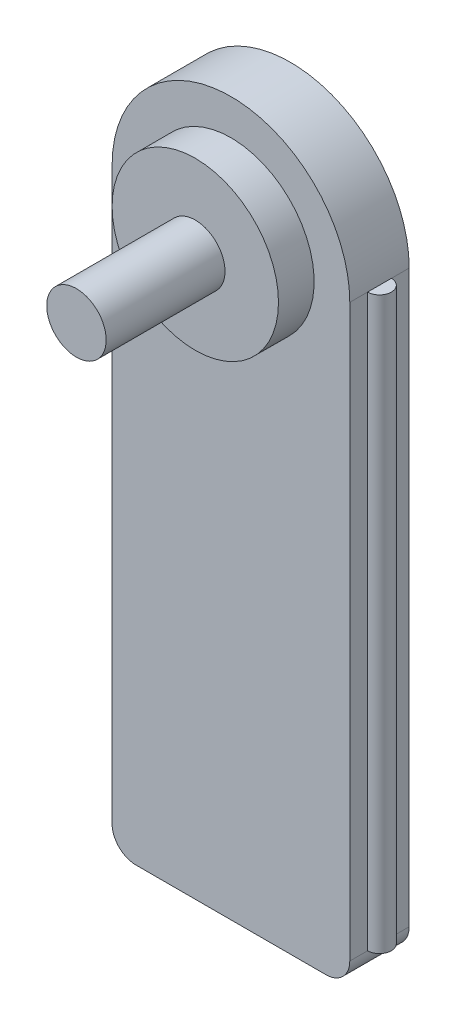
from build123d import *

# Parameters (mm, degrees)
EXTRUDE_1_DEPTH = 5
SKETCH_2_R      = 7
EXTRUDE_2_DEPTH = 3
SKETCH_3_R      = 2.5
EXTRUDE_3_DEPTH = 10
SKETCH_4_R      = 1
EXTRUDE_4_DEPTH = 48


with BuildPart() as part:
    # Sketch 1 → Extrude 1 (new body)
    with BuildSketch(Plane.XY):
        with BuildLine():
            Line((-10, 0), (-10, -48))
            ThreePointArc((-10, -48), (-9.414213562, -49.414213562), (-8, -50))
            Line((-8, -50), (8, -50))
            ThreePointArc((8, -50), (9.414213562, -49.414213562), (10, -48))
            Line((10, -48), (10, 0))
            ThreePointArc((10, 0), (0, 10), (-10, 0))
        make_face()
    extrude(amount=EXTRUDE_1_DEPTH)

    # Sketch 2 → Extrude 2 (add)
    with BuildSketch(Plane.XY.offset(5)):
        with Locations(Location((0, 0, 0), (0, 0, 180))):
            Circle(SKETCH_2_R)
    extrude(amount=EXTRUDE_2_DEPTH)

    # Sketch 3 → Extrude 3 (add)
    with BuildSketch(Plane.XY.offset(8)):
        Circle(SKETCH_3_R)
    extrude(amount=EXTRUDE_3_DEPTH)

    # Sketch 4 → Extrude 4 (add)
    with BuildSketch(Plane(origin=(0, 0, 0), x_dir=(1, 0, 0), z_dir=(0, 1, 0))):
        with Locations((10, -2.5)):
            Circle(SKETCH_4_R)
    extrude_4 = extrude(amount=-EXTRUDE_4_DEPTH)

    # Mirror 1: Extrude 4 across plane
    add(extrude_4.mirror(Plane(origin=(0, 0, 0), x_dir=(0, 0, 1), z_dir=(1, 0, 0))))


solid = part.part
